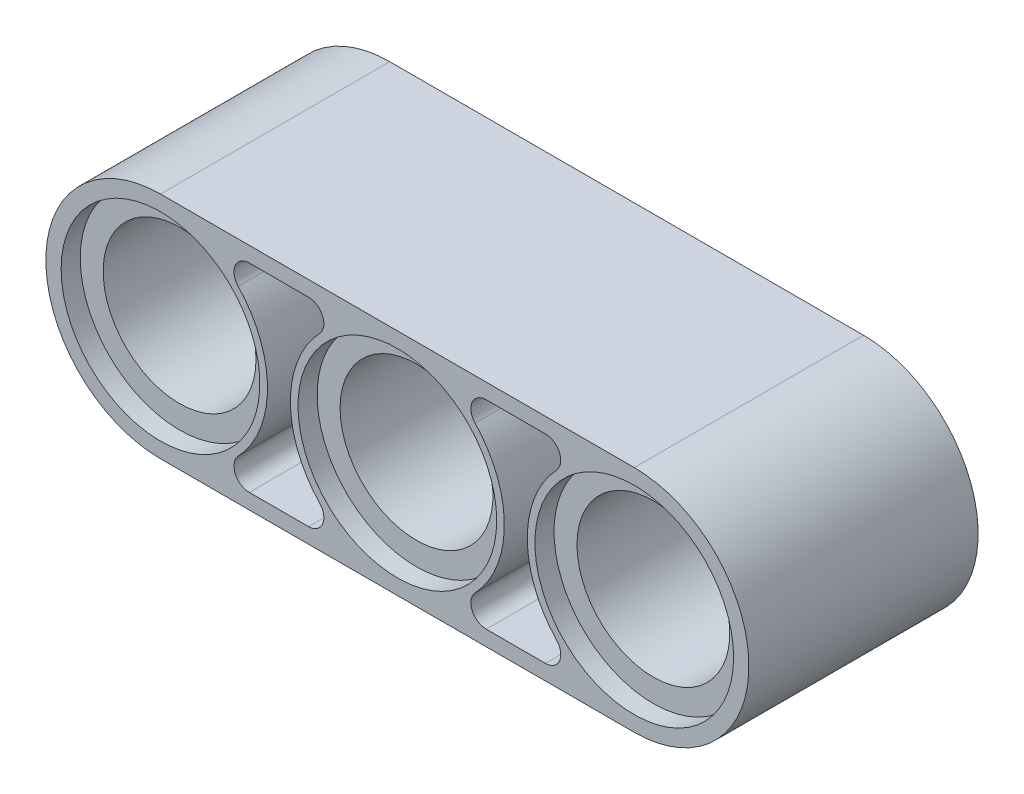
from build123d import *

# Parameters (mm, degrees)
SKETCH1_R           = 3.302
SKETCH1_R_2         = 2.54
BOSS_EXTRUDE1_DEPTH = 3.81
SKETCH1_7_R         = 2.54
BOSS_EXTRUDE2_DEPTH = 3.81
SKETCH2_R           = 3.302
CUT_EXTRUDE1_DEPTH  = 0.635


with BuildPart() as part:
    # Sketch1 → Boss-Extrude1 (new body)
    # profile 1 of 2: a face of its own
    with BuildSketch(Plane.XY):
        with BuildLine():
            Line((3.937, -3.81), (7.874, -3.81))
            ThreePointArc((7.874, -3.81), (11.684, 0), (7.874, 3.81))
            Line((7.874, 3.81), (3.937, 3.81))
            Line((3.937, 3.81), (3.937, 3.302))
            Line((3.937, 3.302), (4.92278669, 3.302))
            ThreePointArc((4.92278669, 3.302), (5.389414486, 2.994804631), (5.291688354, 2.44475))
            ThreePointArc((5.291688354, 2.44475), (4.318, 0), (5.291688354, -2.44475))
            ThreePointArc((5.291688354, -2.44475), (5.389414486, -2.994804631), (4.92278669, -3.302))
            Line((4.92278669, -3.302), (3.937, -3.302))
            Line((3.937, -3.302), (3.937, -3.81))
        make_face()
        with Locations((7.874, 0)):
            Circle(SKETCH1_R, mode=Mode.SUBTRACT)
    # profile 2 of 2: a face of its own
    with BuildSketch(Plane.XY):
        with Locations((7.874, 0)):
            Circle(SKETCH1_R)
        with Locations(Location((7.874, 0, 0), (0, 0, 180))):
            Circle(SKETCH1_R_2, mode=Mode.SUBTRACT)
    extrude(amount=BOSS_EXTRUDE1_DEPTH)


with BuildPart() as body_2:
    # Sketch1_7 → Boss-Extrude2 (new body)
    with BuildSketch(Plane.XY):
        with BuildLine():
            Line((3.937, -3.81), (3.937, -3.302))
            Line((3.937, -3.302), (2.95121331, -3.302))
            ThreePointArc((2.95121331, -3.302), (2.484585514, -2.994804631), (2.582311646, -2.44475))
            ThreePointArc((2.582311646, -2.44475), (3.556, 0), (2.582311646, 2.44475))
            ThreePointArc((2.582311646, 2.44475), (2.484585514, 2.994804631), (2.95121331, 3.302))
            Line((2.95121331, 3.302), (3.937, 3.302))
            Line((3.937, 3.302), (3.937, 3.81))
            Line((3.937, 3.81), (-3.937, 3.81))
            Line((-3.937, 3.81), (-3.937, 3.302))
            Line((-3.937, 3.302), (-2.95121331, 3.302))
            ThreePointArc((-2.95121331, 3.302), (-2.484585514, 2.994804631), (-2.582311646, 2.44475))
            ThreePointArc((-2.582311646, 2.44475), (-3.556, 0), (-2.582311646, -2.44475))
            ThreePointArc((-2.582311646, -2.44475), (-2.484585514, -2.994804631), (-2.95121331, -3.302))
            Line((-2.95121331, -3.302), (-3.937, -3.302))
            Line((-3.937, -3.302), (-3.937, -3.81))
            Line((-3.937, -3.81), (3.937, -3.81))
        make_face()
        with Locations(Location((0, 0, 0), (0, 0, 180))):
            Circle(SKETCH1_7_R, mode=Mode.SUBTRACT)
    extrude(amount=BOSS_EXTRUDE2_DEPTH)


with BuildPart() as cut_extrude1_tool:
    # Sketch2 → Cut-Extrude1 (new body)
    with BuildSketch(Plane.XY):
        with Locations((7.874, 0)):
            Circle(SKETCH2_R)
        Circle(SKETCH2_R)
    extrude(amount=CUT_EXTRUDE1_DEPTH)


with BuildPart() as part_1:
    add(part.part)

    # Cut-Extrude1: cut by cut_extrude1_tool
    add(cut_extrude1_tool.part, mode=Mode.SUBTRACT)


with BuildPart() as body_2_1:
    add(body_2.part)

    # Cut-Extrude1: cut by cut_extrude1_tool
    add(cut_extrude1_tool.part, mode=Mode.SUBTRACT)


with BuildPart() as body_3:
    # Mirror2: mirrored copy
    add(part_1.part.mirror(Plane(origin=(0, 0, 0), x_dir=(0, 0, 1), z_dir=(1, 0, 0))))


with BuildPart() as part_2:
    add(part_1.part)

    # Combine1: union body 3, body 2
    add(body_3.part)
    add(body_2_1.part)

    # Mirror3: part across plane


with BuildPart() as part_3:
    add(part_2.part)
    add(part_2.part.mirror(Plane.XY.offset(3.81)))


solid = part_3.part
